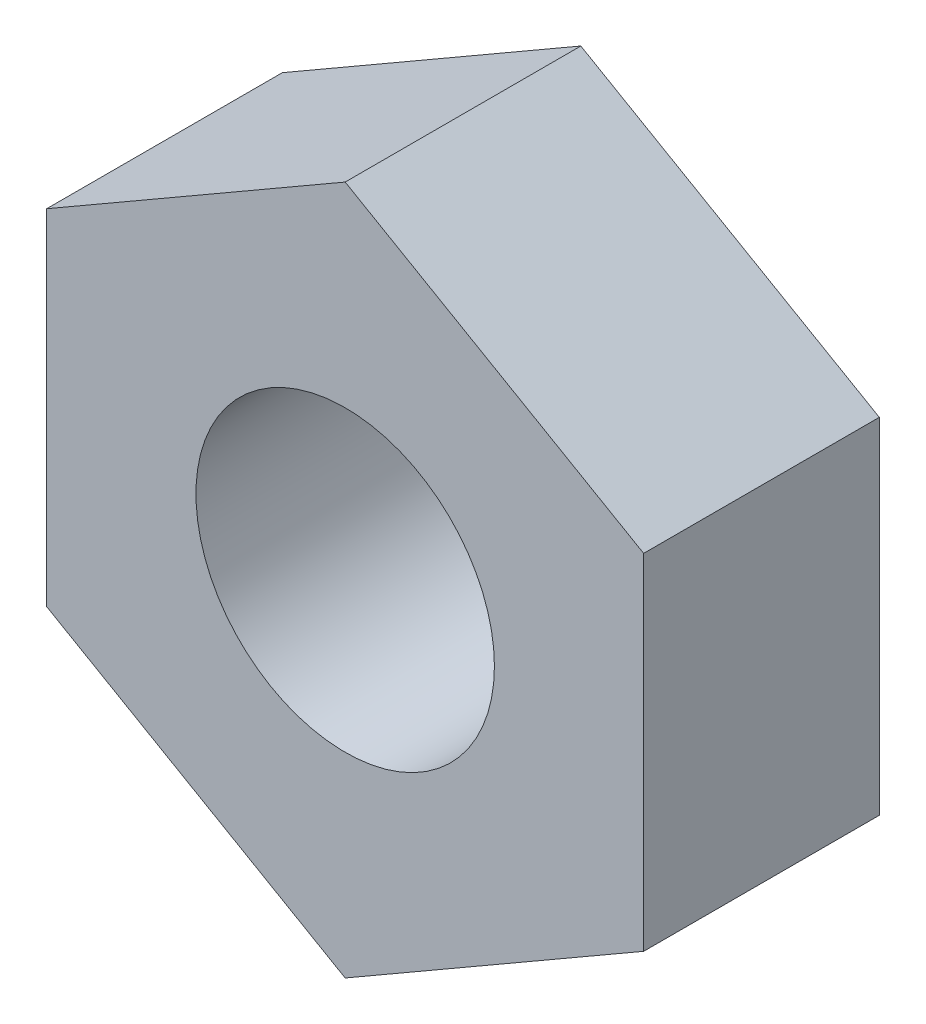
from build123d import *

# Parameters (mm, degrees)
ESQUISSE1_R      = 0.95
EXTRUSION1_DEPTH = 1.5


with BuildPart() as part:
    # Esquisse1 → Extrusion1 (new body)
    with BuildSketch(Plane.XY):
        Polygon((0, 2.193931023), (-1.9, 1.096965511), (-1.9, -1.096965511), (0, -2.193931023), (1.9, -1.096965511), (1.9, 1.096965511), align=None)
        Circle(ESQUISSE1_R, mode=Mode.SUBTRACT)
    extrude(amount=EXTRUSION1_DEPTH)


solid = part.part
